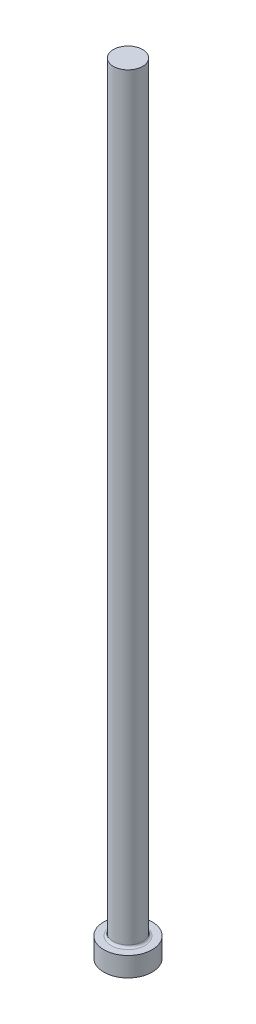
from build123d import *


with BuildPart() as part:
    # Sketch1 → Revolve1 (revolve)
    with BuildSketch(Plane.XY, mode=Mode.PRIVATE) as revolve1_sk:
        with BuildLine():
            Line((0, 0), (7.874, 0))
            Line((7.874, 0), (7.874, 6.35))
            Line((7.874, 6.35), (5.5245, 6.35))
            ThreePointArc((5.5245, 6.35), (4.985684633, 6.573184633), (4.7625, 7.112))
            Line((4.7625, 7.112), (4.7625, 254))
            Line((4.7625, 254), (0, 254))
            Line((0, 254), (0, 0))
        make_face()
    revolve(revolve1_sk.sketch.rotate(Axis((0, 254, 0), (0, -1, 0)), 180), axis=Axis((0, 254, 0), (0, -1, 0)))


solid = part.part
